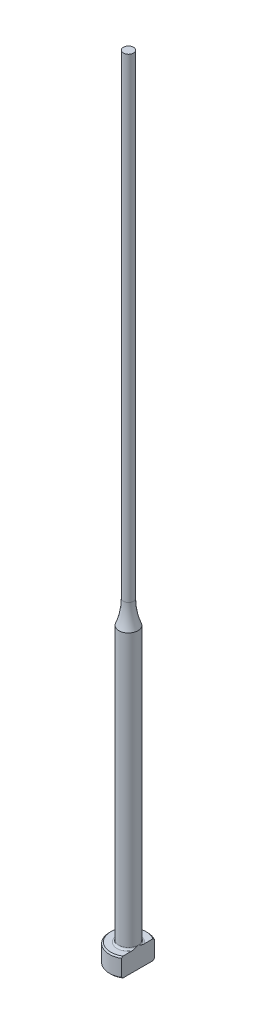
from build123d import *
from build123d.topology import SkipClean

# Parameters (mm, degrees)
CHAMFER1_SIZE = 0.2
FILLET1_R     = 0.3
KEY_DEPTH     = 126.071979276


with BuildPart() as part:
    # Sketch1 → Revolve1 (revolve)
    with BuildSketch(Plane.XY, mode=Mode.PRIVATE) as revolve1_sk:
        with BuildLine():
            Line((0, 0), (-3, 0))
            Line((-3, 0), (-3, 3))
            Line((-3, 3), (-1.5, 3))
            Line((-1.5, 3), (-1.5, 46.32440481))
            ThreePointArc((-1.5, 46.32440481), (-0.976558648, 48.129171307), (-0.8, 50))
            Line((-0.8, 50), (-0.8, 125))
            Line((-0.8, 125), (0, 125))
            Line((0, 125), (0, 0))
        make_face()
    revolve(revolve1_sk.sketch.rotate(Axis((0, 259.958771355, 0), (0, -1, 0)), 270), axis=Axis((0, 259.958771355, 0), (0, -1, 0)))

    # Chamfer1
    chamfer1_edges = [part.edges().sort_by_distance(p)[0] for p in [
        (0, 0, -3),
        (0, 3, -3),
    ]]
    chamfer(chamfer1_edges, length=CHAMFER1_SIZE)

    # Fillet1
    fillet1_edges = [part.edges().sort_by_distance(p)[0] for p in [
        (0, 3, -1.5),
    ]]
    fillet(fillet1_edges, radius=FILLET1_R)

    # Sketch2 → KEY (cut, through all)
    with SkipClean():  # the faces are left unmerged after this step: merging them gives an invalid solid
        with BuildSketch(Plane(origin=(0, 0, 0), x_dir=(1, 0, 0), z_dir=(0, 1, 0))):
            with BuildLine():
                Line((1.5, 2.598076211), (1.5, -2.598076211))
                ThreePointArc((1.5, -2.598076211), (3, 0), (1.5, 2.598076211))
            make_face()
        extrude(amount=KEY_DEPTH, mode=Mode.SUBTRACT)


solid = part.part
